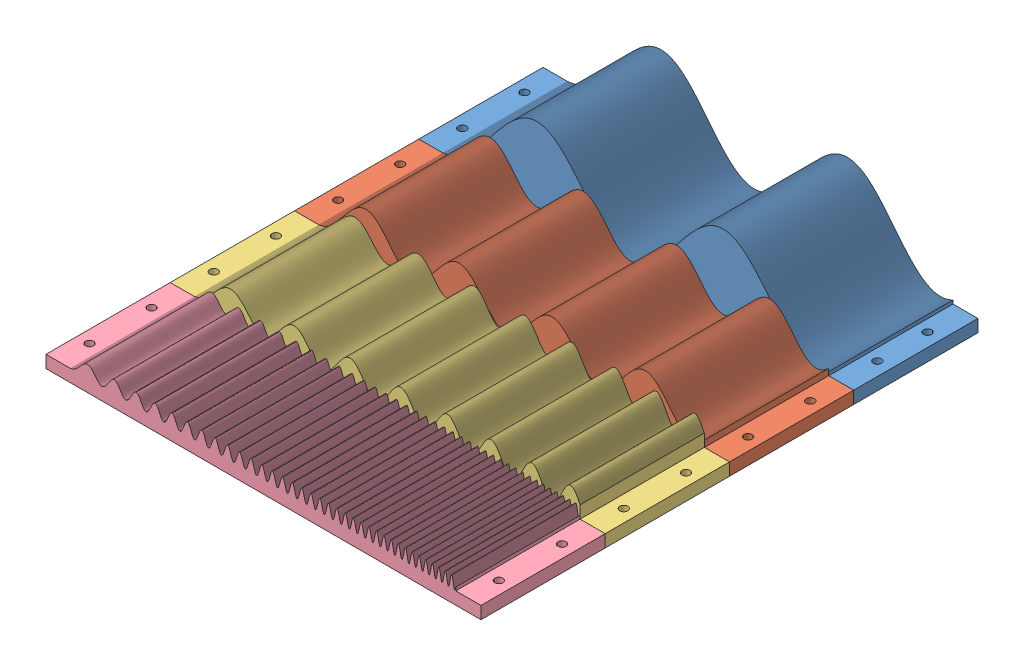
SolidWorks assembly Assem1.sldasm, configuration Default (file format 10000). Lengths in mm.
Overall size (350 69.75 400).
4 component instances, 4 part files, 8 mates.
Components (placement in the parent):
- sineRow1-1: sineRow1.SLDPRT [Default] at (-98.478 142.9933 267.8109) size (350 69.75 100)
- sineRow2-1: sineRow2.SLDPRT [Default] at (-98.478 142.9933 367.8109) size (350 39.75 100)
- sineRow3-1: sineRow3.SLDPRT [Default] at (-98.478 142.9933 467.8109) size (350 29.75 100)
- sineRow4-1: sineRow4.SLDPRT [Default] at (-98.478 142.9933 567.8109) size (350 19.75 100)
Mates (geometry in assembly coordinates):
- Coincident1: coincident: plane of sineRow1-1 through (-98.478 142.9933 367.8109) normal (0 0 1); plane of sineRow2-1 through (-98.478 142.9933 367.8109) normal (0 0 -1)
- Coincident2: coincident: line of sineRow1-1 through (-118.478 132.9933 367.8109) axis (1 0 0); line of sineRow2-1 through (-118.478 132.9933 367.8109) axis (1 0 0)
- Coincident3: coincident aligned: plane of sineRow1-1 through (-118.478 142.9933 367.8109) normal (-1 0 0); plane of sineRow2-1 through (-118.478 142.9933 467.8109) normal (-1 0 0)
- Coincident4: coincident: plane of sineRow2-1 through (-118.478 142.9933 467.8109) normal (-1 0 0); plane of sineRow3-1 through (-118.478 142.9933 567.8109) normal (-1 0 0)
- Coincident5: coincident: plane of sineRow2-1 through (-98.478 142.9933 467.8109) normal (0 0 1); plane of sineRow3-1 through (-98.478 142.9933 467.8109) normal (0 0 -1)
- Coincident6: coincident aligned: line of sineRow2-1 through (-118.478 132.9933 467.8109) axis (1 0 0); line of sineRow3-1 through (-118.478 132.9933 467.8109) axis (1 0 0)
- Coincident7: coincident: line of sineRow3-1 through (-118.478 132.9933 567.8109) axis (1 0 0); line of sineRow4-1 through (-118.478 132.9933 567.8109) axis (1 0 0)
- Coincident8: coincident aligned: plane of sineRow3-1 through (-118.478 142.9933 567.8109) normal (-1 0 0); plane of sineRow4-1 through (-118.478 142.9933 667.8109) normal (-1 0 0)
